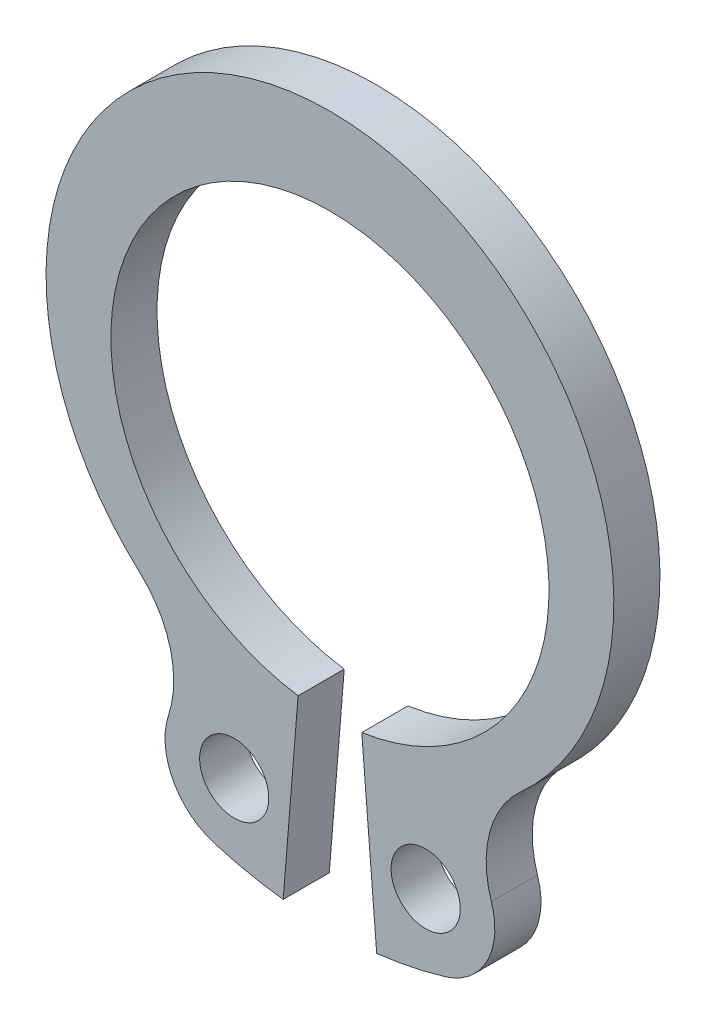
ISO-10303-21;
HEADER;
FILE_DESCRIPTION(('STEP AP214'),'2;1');
FILE_NAME('part.step','',(''),(''),'','','');
FILE_SCHEMA(('AUTOMOTIVE_DESIGN { 1 0 10303 214 1 1 1 1 }'));
ENDSEC;
DATA;
#1=APPLICATION_CONTEXT('core data for automotive mechanical design processes');
#2=APPLICATION_PROTOCOL_DEFINITION('international standard','automotive_design',2000,#1);
#3=PRODUCT_CONTEXT('',#1,'mechanical');
#4=PRODUCT('Part','Part','',(#3));
#5=PRODUCT_RELATED_PRODUCT_CATEGORY('part','',(#4));
#6=PRODUCT_DEFINITION_FORMATION('','',#4);
#7=PRODUCT_DEFINITION_CONTEXT('part definition',#1,'design');
#8=PRODUCT_DEFINITION('design','',#6,#7);
#9=PRODUCT_DEFINITION_SHAPE('','',#8);
#10=(LENGTH_UNIT() NAMED_UNIT(*) SI_UNIT(.MILLI.,.METRE.));
#11=(NAMED_UNIT(*) PLANE_ANGLE_UNIT() SI_UNIT($,.RADIAN.));
#12=(NAMED_UNIT(*) SI_UNIT($,.STERADIAN.) SOLID_ANGLE_UNIT());
#13=UNCERTAINTY_MEASURE_WITH_UNIT(LENGTH_MEASURE(1.E-05),#10,'distance_accuracy_value','');
#14=(GEOMETRIC_REPRESENTATION_CONTEXT(3) GLOBAL_UNCERTAINTY_ASSIGNED_CONTEXT((#13)) GLOBAL_UNIT_ASSIGNED_CONTEXT((#10,
#11,#12)) REPRESENTATION_CONTEXT('',''));
#15=CARTESIAN_POINT('',(0.,0.,0.));
#16=DIRECTION('',(0.,0.,1.));
#17=DIRECTION('',(1.,0.,0.));
#18=AXIS2_PLACEMENT_3D('',#15,#16,#17);
#19=CARTESIAN_POINT('',(0.,0.,0.800000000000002));
#20=DIRECTION('',(0.,0.,1.));
#21=DIRECTION('',(1.,0.,0.));
#22=AXIS2_PLACEMENT_3D('',#19,#20,#21);
#23=PLANE('',#22);
#24=CARTESIAN_POINT('',(-1.6610565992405,-5.55323839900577,0.800000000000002));
#25=DIRECTION('',(0.,0.,1.));
#26=DIRECTION('',(-1.,0.,0.));
#27=AXIS2_PLACEMENT_3D('',#24,#25,#26);
#28=CIRCLE('',#27,0.6);
#29=CARTESIAN_POINT('',(-2.2610565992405,-5.55323839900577,0.800000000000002));
#30=VERTEX_POINT('',#29);
#31=EDGE_CURVE('E120',#30,#30,#28,.T.);
#32=ORIENTED_EDGE('',*,*,#31,.F.);
#33=EDGE_LOOP('',(#32));
#34=FACE_BOUND('',#33,.T.);
#35=CARTESIAN_POINT('',(0.,0.,0.800000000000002));
#36=DIRECTION('',(0.,0.,-1.));
#37=DIRECTION('',(1.,0.,0.));
#38=AXIS2_PLACEMENT_3D('',#35,#36,#37);
#39=CIRCLE('',#38,3.8);
#40=CARTESIAN_POINT('',(-0.552363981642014,-3.75964014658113,0.800000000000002));
#41=VERTEX_POINT('',#40);
#42=CARTESIAN_POINT('',(0.552363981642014,-3.75964014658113,0.800000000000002));
#43=VERTEX_POINT('',#42);
#44=EDGE_CURVE('E142',#41,#43,#39,.T.);
#45=ORIENTED_EDGE('',*,*,#44,.T.);
#46=DIRECTION('',(0.0808768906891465,-0.996724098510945,0.));
#47=VECTOR('',#46,1.);
#48=CARTESIAN_POINT('',(0.552363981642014,-3.75964014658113,0.800000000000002));
#49=LINE('',#48,#47);
#50=CARTESIAN_POINT('',(0.811170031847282,-6.94915726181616,0.800000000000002));
#51=VERTEX_POINT('',#50);
#52=EDGE_CURVE('E115',#43,#51,#49,.T.);
#53=ORIENTED_EDGE('',*,*,#52,.T.);
#54=CARTESIAN_POINT('',(0.,0.,0.800000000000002));
#55=DIRECTION('',(0.,0.,1.));
#56=DIRECTION('',(1.,0.,0.));
#57=AXIS2_PLACEMENT_3D('',#54,#55,#56);
#58=CIRCLE('',#57,6.99634071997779);
#59=CARTESIAN_POINT('',(2.00494044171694,-6.70290961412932,0.800000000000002));
#60=VERTEX_POINT('',#59);
#61=EDGE_CURVE('E145',#51,#60,#58,.T.);
#62=ORIENTED_EDGE('',*,*,#61,.T.);
#63=CARTESIAN_POINT('',(1.6610565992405,-5.55323839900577,0.800000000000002));
#64=DIRECTION('',(0.,0.,1.));
#65=DIRECTION('',(1.,0.,0.));
#66=AXIS2_PLACEMENT_3D('',#63,#64,#65);
#67=CIRCLE('',#66,1.2);
#68=CARTESIAN_POINT('',(2.80066030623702,-5.17733496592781,0.800000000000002));
#69=VERTEX_POINT('',#68);
#70=EDGE_CURVE('E147',#60,#69,#67,.T.);
#71=ORIENTED_EDGE('',*,*,#70,.T.);
#72=CARTESIAN_POINT('',(4.51006586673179,-4.61347981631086,0.800000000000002));
#73=DIRECTION('',(0.,0.,-1.));
#74=DIRECTION('',(1.,0.,0.));
#75=AXIS2_PLACEMENT_3D('',#72,#73,#74);
#76=CIRCLE('',#75,1.8);
#77=CARTESIAN_POINT('',(3.30291069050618,-3.2782733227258,0.800000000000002));
#78=VERTEX_POINT('',#77);
#79=EDGE_CURVE('E149',#69,#78,#76,.T.);
#80=ORIENTED_EDGE('',*,*,#79,.T.);
#81=CARTESIAN_POINT('',(0.,0.375,0.800000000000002));
#82=DIRECTION('',(0.,0.,1.));
#83=DIRECTION('',(1.,0.,0.));
#84=AXIS2_PLACEMENT_3D('',#81,#82,#83);
#85=CIRCLE('',#84,4.925);
#86=CARTESIAN_POINT('',(-3.30291069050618,-3.2782733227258,0.800000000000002));
#87=VERTEX_POINT('',#86);
#88=EDGE_CURVE('E151',#78,#87,#85,.T.);
#89=ORIENTED_EDGE('',*,*,#88,.T.);
#90=CARTESIAN_POINT('',(-4.51006586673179,-4.61347981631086,0.800000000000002));
#91=DIRECTION('',(0.,0.,-1.));
#92=DIRECTION('',(-1.,0.,0.));
#93=AXIS2_PLACEMENT_3D('',#90,#91,#92);
#94=CIRCLE('',#93,1.8);
#95=CARTESIAN_POINT('',(-2.80066030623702,-5.17733496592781,0.800000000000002));
#96=VERTEX_POINT('',#95);
#97=EDGE_CURVE('E153',#87,#96,#94,.T.);
#98=ORIENTED_EDGE('',*,*,#97,.T.);
#99=CARTESIAN_POINT('',(-1.6610565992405,-5.55323839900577,0.800000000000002));
#100=DIRECTION('',(0.,0.,1.));
#101=DIRECTION('',(-1.,0.,0.));
#102=AXIS2_PLACEMENT_3D('',#99,#100,#101);
#103=CIRCLE('',#102,1.2);
#104=CARTESIAN_POINT('',(-2.00494044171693,-6.70290961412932,0.800000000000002));
#105=VERTEX_POINT('',#104);
#106=EDGE_CURVE('E155',#96,#105,#103,.T.);
#107=ORIENTED_EDGE('',*,*,#106,.T.);
#108=CARTESIAN_POINT('',(0.,0.,0.800000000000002));
#109=DIRECTION('',(0.,0.,1.));
#110=DIRECTION('',(-1.,0.,0.));
#111=AXIS2_PLACEMENT_3D('',#108,#109,#110);
#112=CIRCLE('',#111,6.99634071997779);
#113=CARTESIAN_POINT('',(-0.811170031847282,-6.94915726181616,0.800000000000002));
#114=VERTEX_POINT('',#113);
#115=EDGE_CURVE('E44',#105,#114,#112,.T.);
#116=ORIENTED_EDGE('',*,*,#115,.T.);
#117=DIRECTION('',(0.0808768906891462,0.996724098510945,0.));
#118=VECTOR('',#117,1.);
#119=CARTESIAN_POINT('',(-0.552363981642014,-3.75964014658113,0.800000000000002));
#120=LINE('',#119,#118);
#121=EDGE_CURVE('E39',#114,#41,#120,.T.);
#122=ORIENTED_EDGE('',*,*,#121,.T.);
#123=EDGE_LOOP('',(#45,#53,#62,#71,#80,#89,#98,#107,#116,#122));
#124=FACE_BOUND('',#123,.T.);
#125=CARTESIAN_POINT('',(1.6610565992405,-5.55323839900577,0.800000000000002));
#126=DIRECTION('',(0.,0.,1.));
#127=DIRECTION('',(1.,0.,0.));
#128=AXIS2_PLACEMENT_3D('',#125,#126,#127);
#129=CIRCLE('',#128,0.6);
#130=CARTESIAN_POINT('',(2.2610565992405,-5.55323839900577,0.800000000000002));
#131=VERTEX_POINT('',#130);
#132=EDGE_CURVE('E242',#131,#131,#129,.T.);
#133=ORIENTED_EDGE('',*,*,#132,.F.);
#134=EDGE_LOOP('',(#133));
#135=FACE_BOUND('',#134,.T.);
#136=ADVANCED_FACE('F24',(#34,#124,#135),#23,.T.);
#137=CARTESIAN_POINT('',(0.,0.,0.));
#138=DIRECTION('',(0.,0.,1.));
#139=DIRECTION('',(1.,0.,0.));
#140=AXIS2_PLACEMENT_3D('',#137,#138,#139);
#141=PLANE('',#140);
#142=CARTESIAN_POINT('',(-1.6610565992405,-5.55323839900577,0.));
#143=DIRECTION('',(0.,0.,1.));
#144=DIRECTION('',(-1.,0.,0.));
#145=AXIS2_PLACEMENT_3D('',#142,#143,#144);
#146=CIRCLE('',#145,0.6);
#147=CARTESIAN_POINT('',(-2.2610565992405,-5.55323839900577,0.));
#148=VERTEX_POINT('',#147);
#149=EDGE_CURVE('E123',#148,#148,#146,.T.);
#150=ORIENTED_EDGE('',*,*,#149,.T.);
#151=EDGE_LOOP('',(#150));
#152=FACE_BOUND('',#151,.T.);
#153=CARTESIAN_POINT('',(0.,0.,0.));
#154=DIRECTION('',(0.,0.,-1.));
#155=DIRECTION('',(1.,0.,0.));
#156=AXIS2_PLACEMENT_3D('',#153,#154,#155);
#157=CIRCLE('',#156,3.8);
#158=CARTESIAN_POINT('',(-0.552363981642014,-3.75964014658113,0.));
#159=VERTEX_POINT('',#158);
#160=CARTESIAN_POINT('',(0.552363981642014,-3.75964014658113,0.));
#161=VERTEX_POINT('',#160);
#162=EDGE_CURVE('E106',#159,#161,#157,.T.);
#163=ORIENTED_EDGE('',*,*,#162,.F.);
#164=DIRECTION('',(0.0808768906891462,0.996724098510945,0.));
#165=VECTOR('',#164,1.);
#166=CARTESIAN_POINT('',(-0.552363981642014,-3.75964014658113,0.));
#167=LINE('',#166,#165);
#168=CARTESIAN_POINT('',(-0.811170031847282,-6.94915726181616,0.));
#169=VERTEX_POINT('',#168);
#170=EDGE_CURVE('E140',#169,#159,#167,.T.);
#171=ORIENTED_EDGE('',*,*,#170,.F.);
#172=CARTESIAN_POINT('',(0.,0.,0.));
#173=DIRECTION('',(0.,0.,1.));
#174=DIRECTION('',(-1.,0.,0.));
#175=AXIS2_PLACEMENT_3D('',#172,#173,#174);
#176=CIRCLE('',#175,6.99634071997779);
#177=CARTESIAN_POINT('',(-2.00494044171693,-6.70290961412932,0.));
#178=VERTEX_POINT('',#177);
#179=EDGE_CURVE('E138',#178,#169,#176,.T.);
#180=ORIENTED_EDGE('',*,*,#179,.F.);
#181=CARTESIAN_POINT('',(-1.6610565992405,-5.55323839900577,0.));
#182=DIRECTION('',(0.,0.,1.));
#183=DIRECTION('',(-1.,0.,0.));
#184=AXIS2_PLACEMENT_3D('',#181,#182,#183);
#185=CIRCLE('',#184,1.2);
#186=CARTESIAN_POINT('',(-2.80066030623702,-5.17733496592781,0.));
#187=VERTEX_POINT('',#186);
#188=EDGE_CURVE('E136',#187,#178,#185,.T.);
#189=ORIENTED_EDGE('',*,*,#188,.F.);
#190=CARTESIAN_POINT('',(-4.51006586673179,-4.61347981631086,0.));
#191=DIRECTION('',(0.,0.,-1.));
#192=DIRECTION('',(-1.,0.,0.));
#193=AXIS2_PLACEMENT_3D('',#190,#191,#192);
#194=CIRCLE('',#193,1.8);
#195=CARTESIAN_POINT('',(-3.30291069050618,-3.2782733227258,0.));
#196=VERTEX_POINT('',#195);
#197=EDGE_CURVE('E134',#196,#187,#194,.T.);
#198=ORIENTED_EDGE('',*,*,#197,.F.);
#199=CARTESIAN_POINT('',(0.,0.375,0.));
#200=DIRECTION('',(0.,0.,1.));
#201=DIRECTION('',(1.,0.,0.));
#202=AXIS2_PLACEMENT_3D('',#199,#200,#201);
#203=CIRCLE('',#202,4.925);
#204=CARTESIAN_POINT('',(3.30291069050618,-3.2782733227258,0.));
#205=VERTEX_POINT('',#204);
#206=EDGE_CURVE('E132',#205,#196,#203,.T.);
#207=ORIENTED_EDGE('',*,*,#206,.F.);
#208=CARTESIAN_POINT('',(4.51006586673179,-4.61347981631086,0.));
#209=DIRECTION('',(0.,0.,-1.));
#210=DIRECTION('',(1.,0.,0.));
#211=AXIS2_PLACEMENT_3D('',#208,#209,#210);
#212=CIRCLE('',#211,1.8);
#213=CARTESIAN_POINT('',(2.80066030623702,-5.17733496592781,0.));
#214=VERTEX_POINT('',#213);
#215=EDGE_CURVE('E130',#214,#205,#212,.T.);
#216=ORIENTED_EDGE('',*,*,#215,.F.);
#217=CARTESIAN_POINT('',(1.6610565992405,-5.55323839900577,0.));
#218=DIRECTION('',(0.,0.,1.));
#219=DIRECTION('',(1.,0.,0.));
#220=AXIS2_PLACEMENT_3D('',#217,#218,#219);
#221=CIRCLE('',#220,1.2);
#222=CARTESIAN_POINT('',(2.00494044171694,-6.70290961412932,0.));
#223=VERTEX_POINT('',#222);
#224=EDGE_CURVE('E128',#223,#214,#221,.T.);
#225=ORIENTED_EDGE('',*,*,#224,.F.);
#226=CARTESIAN_POINT('',(0.,0.,0.));
#227=DIRECTION('',(0.,0.,1.));
#228=DIRECTION('',(1.,0.,0.));
#229=AXIS2_PLACEMENT_3D('',#226,#227,#228);
#230=CIRCLE('',#229,6.99634071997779);
#231=CARTESIAN_POINT('',(0.811170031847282,-6.94915726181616,0.));
#232=VERTEX_POINT('',#231);
#233=EDGE_CURVE('E108',#232,#223,#230,.T.);
#234=ORIENTED_EDGE('',*,*,#233,.F.);
#235=DIRECTION('',(0.0808768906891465,-0.996724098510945,0.));
#236=VECTOR('',#235,1.);
#237=CARTESIAN_POINT('',(0.552363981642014,-3.75964014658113,0.));
#238=LINE('',#237,#236);
#239=EDGE_CURVE('E101',#161,#232,#238,.T.);
#240=ORIENTED_EDGE('',*,*,#239,.F.);
#241=EDGE_LOOP('',(#163,#171,#180,#189,#198,#207,#216,#225,#234,#240));
#242=FACE_BOUND('',#241,.T.);
#243=CARTESIAN_POINT('',(1.6610565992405,-5.55323839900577,0.));
#244=DIRECTION('',(0.,0.,1.));
#245=DIRECTION('',(1.,0.,0.));
#246=AXIS2_PLACEMENT_3D('',#243,#244,#245);
#247=CIRCLE('',#246,0.6);
#248=CARTESIAN_POINT('',(2.2610565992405,-5.55323839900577,0.));
#249=VERTEX_POINT('',#248);
#250=EDGE_CURVE('E245',#249,#249,#247,.T.);
#251=ORIENTED_EDGE('',*,*,#250,.T.);
#252=EDGE_LOOP('',(#251));
#253=FACE_BOUND('',#252,.T.);
#254=ADVANCED_FACE('F102',(#152,#242,#253),#141,.F.);
#255=CARTESIAN_POINT('',(0.,0.,0.800000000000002));
#256=DIRECTION('',(0.,0.,-1.));
#257=DIRECTION('',(-1.,0.,0.));
#258=AXIS2_PLACEMENT_3D('',#255,#256,#257);
#259=CYLINDRICAL_SURFACE('',#258,3.8);
#260=ORIENTED_EDGE('',*,*,#162,.T.);
#261=DIRECTION('',(0.,0.,-1.));
#262=VECTOR('',#261,1.);
#263=CARTESIAN_POINT('',(0.552363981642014,-3.75964014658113,0.800000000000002));
#264=LINE('',#263,#262);
#265=EDGE_CURVE('E11',#43,#161,#264,.T.);
#266=ORIENTED_EDGE('',*,*,#265,.F.);
#267=ORIENTED_EDGE('',*,*,#44,.F.);
#268=DIRECTION('',(0.,0.,-1.));
#269=VECTOR('',#268,1.);
#270=CARTESIAN_POINT('',(-0.552363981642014,-3.75964014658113,0.800000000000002));
#271=LINE('',#270,#269);
#272=EDGE_CURVE('E119',#41,#159,#271,.T.);
#273=ORIENTED_EDGE('',*,*,#272,.T.);
#274=EDGE_LOOP('',(#260,#266,#267,#273));
#275=FACE_BOUND('',#274,.T.);
#276=ADVANCED_FACE('F26',(#275),#259,.F.);
#277=CARTESIAN_POINT('',(0.552363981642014,-3.75964014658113,0.800000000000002));
#278=DIRECTION('',(0.996724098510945,0.0808768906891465,0.));
#279=DIRECTION('',(-0.0808768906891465,0.996724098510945,0.));
#280=AXIS2_PLACEMENT_3D('',#277,#278,#279);
#281=PLANE('',#280);
#282=ORIENTED_EDGE('',*,*,#239,.T.);
#283=DIRECTION('',(0.,0.,-1.));
#284=VECTOR('',#283,1.);
#285=CARTESIAN_POINT('',(0.811170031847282,-6.94915726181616,0.800000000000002));
#286=LINE('',#285,#284);
#287=EDGE_CURVE('E32',#51,#232,#286,.T.);
#288=ORIENTED_EDGE('',*,*,#287,.F.);
#289=ORIENTED_EDGE('',*,*,#52,.F.);
#290=ORIENTED_EDGE('',*,*,#265,.T.);
#291=EDGE_LOOP('',(#282,#288,#289,#290));
#292=FACE_BOUND('',#291,.T.);
#293=ADVANCED_FACE('F114',(#292),#281,.F.);
#294=CARTESIAN_POINT('',(0.,0.,0.800000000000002));
#295=DIRECTION('',(0.,0.,-1.));
#296=DIRECTION('',(-1.,0.,0.));
#297=AXIS2_PLACEMENT_3D('',#294,#295,#296);
#298=CYLINDRICAL_SURFACE('',#297,6.99634071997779);
#299=ORIENTED_EDGE('',*,*,#233,.T.);
#300=DIRECTION('',(0.,0.,-1.));
#301=VECTOR('',#300,1.);
#302=CARTESIAN_POINT('',(2.00494044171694,-6.70290961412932,0.800000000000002));
#303=LINE('',#302,#301);
#304=EDGE_CURVE('E178',#60,#223,#303,.T.);
#305=ORIENTED_EDGE('',*,*,#304,.F.);
#306=ORIENTED_EDGE('',*,*,#61,.F.);
#307=ORIENTED_EDGE('',*,*,#287,.T.);
#308=EDGE_LOOP('',(#299,#305,#306,#307));
#309=FACE_BOUND('',#308,.T.);
#310=ADVANCED_FACE('F182',(#309),#298,.T.);
#311=CARTESIAN_POINT('',(1.6610565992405,-5.55323839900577,0.800000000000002));
#312=DIRECTION('',(0.,0.,-1.));
#313=DIRECTION('',(-1.,0.,0.));
#314=AXIS2_PLACEMENT_3D('',#311,#312,#313);
#315=CYLINDRICAL_SURFACE('',#314,1.2);
#316=ORIENTED_EDGE('',*,*,#224,.T.);
#317=DIRECTION('',(0.,0.,-1.));
#318=VECTOR('',#317,1.);
#319=CARTESIAN_POINT('',(2.80066030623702,-5.17733496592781,0.800000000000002));
#320=LINE('',#319,#318);
#321=EDGE_CURVE('E175',#69,#214,#320,.T.);
#322=ORIENTED_EDGE('',*,*,#321,.F.);
#323=ORIENTED_EDGE('',*,*,#70,.F.);
#324=ORIENTED_EDGE('',*,*,#304,.T.);
#325=EDGE_LOOP('',(#316,#322,#323,#324));
#326=FACE_BOUND('',#325,.T.);
#327=ADVANCED_FACE('F190',(#326),#315,.T.);
#328=CARTESIAN_POINT('',(4.51006586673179,-4.61347981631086,0.800000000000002));
#329=DIRECTION('',(0.,0.,-1.));
#330=DIRECTION('',(-1.,0.,0.));
#331=AXIS2_PLACEMENT_3D('',#328,#329,#330);
#332=CYLINDRICAL_SURFACE('',#331,1.8);
#333=ORIENTED_EDGE('',*,*,#215,.T.);
#334=DIRECTION('',(0.,0.,-1.));
#335=VECTOR('',#334,1.);
#336=CARTESIAN_POINT('',(3.30291069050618,-3.2782733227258,0.800000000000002));
#337=LINE('',#336,#335);
#338=EDGE_CURVE('E172',#78,#205,#337,.T.);
#339=ORIENTED_EDGE('',*,*,#338,.F.);
#340=ORIENTED_EDGE('',*,*,#79,.F.);
#341=ORIENTED_EDGE('',*,*,#321,.T.);
#342=EDGE_LOOP('',(#333,#339,#340,#341));
#343=FACE_BOUND('',#342,.T.);
#344=ADVANCED_FACE('F193',(#343),#332,.F.);
#345=CARTESIAN_POINT('',(0.,0.375,0.800000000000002));
#346=DIRECTION('',(0.,0.,-1.));
#347=DIRECTION('',(-1.,0.,0.));
#348=AXIS2_PLACEMENT_3D('',#345,#346,#347);
#349=CYLINDRICAL_SURFACE('',#348,4.925);
#350=ORIENTED_EDGE('',*,*,#206,.T.);
#351=DIRECTION('',(0.,0.,-1.));
#352=VECTOR('',#351,1.);
#353=CARTESIAN_POINT('',(-3.30291069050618,-3.2782733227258,0.800000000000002));
#354=LINE('',#353,#352);
#355=EDGE_CURVE('E169',#87,#196,#354,.T.);
#356=ORIENTED_EDGE('',*,*,#355,.F.);
#357=ORIENTED_EDGE('',*,*,#88,.F.);
#358=ORIENTED_EDGE('',*,*,#338,.T.);
#359=EDGE_LOOP('',(#350,#356,#357,#358));
#360=FACE_BOUND('',#359,.T.);
#361=ADVANCED_FACE('F198',(#360),#349,.T.);
#362=CARTESIAN_POINT('',(-4.51006586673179,-4.61347981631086,0.800000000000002));
#363=DIRECTION('',(0.,0.,-1.));
#364=DIRECTION('',(-1.,0.,0.));
#365=AXIS2_PLACEMENT_3D('',#362,#363,#364);
#366=CYLINDRICAL_SURFACE('',#365,1.8);
#367=ORIENTED_EDGE('',*,*,#197,.T.);
#368=DIRECTION('',(0.,0.,-1.));
#369=VECTOR('',#368,1.);
#370=CARTESIAN_POINT('',(-2.80066030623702,-5.17733496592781,0.800000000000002));
#371=LINE('',#370,#369);
#372=EDGE_CURVE('E166',#96,#187,#371,.T.);
#373=ORIENTED_EDGE('',*,*,#372,.F.);
#374=ORIENTED_EDGE('',*,*,#97,.F.);
#375=ORIENTED_EDGE('',*,*,#355,.T.);
#376=EDGE_LOOP('',(#367,#373,#374,#375));
#377=FACE_BOUND('',#376,.T.);
#378=ADVANCED_FACE('F204',(#377),#366,.F.);
#379=CARTESIAN_POINT('',(-1.6610565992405,-5.55323839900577,0.800000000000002));
#380=DIRECTION('',(0.,0.,-1.));
#381=DIRECTION('',(-1.,0.,0.));
#382=AXIS2_PLACEMENT_3D('',#379,#380,#381);
#383=CYLINDRICAL_SURFACE('',#382,1.2);
#384=ORIENTED_EDGE('',*,*,#188,.T.);
#385=DIRECTION('',(0.,0.,-1.));
#386=VECTOR('',#385,1.);
#387=CARTESIAN_POINT('',(-2.00494044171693,-6.70290961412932,0.800000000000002));
#388=LINE('',#387,#386);
#389=EDGE_CURVE('E163',#105,#178,#388,.T.);
#390=ORIENTED_EDGE('',*,*,#389,.F.);
#391=ORIENTED_EDGE('',*,*,#106,.F.);
#392=ORIENTED_EDGE('',*,*,#372,.T.);
#393=EDGE_LOOP('',(#384,#390,#391,#392));
#394=FACE_BOUND('',#393,.T.);
#395=ADVANCED_FACE('F208',(#394),#383,.T.);
#396=CARTESIAN_POINT('',(0.,0.,0.800000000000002));
#397=DIRECTION('',(0.,0.,-1.));
#398=DIRECTION('',(-1.,0.,0.));
#399=AXIS2_PLACEMENT_3D('',#396,#397,#398);
#400=CYLINDRICAL_SURFACE('',#399,6.99634071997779);
#401=ORIENTED_EDGE('',*,*,#179,.T.);
#402=DIRECTION('',(0.,0.,-1.));
#403=VECTOR('',#402,1.);
#404=CARTESIAN_POINT('',(-0.811170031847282,-6.94915726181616,0.800000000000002));
#405=LINE('',#404,#403);
#406=EDGE_CURVE('E160',#114,#169,#405,.T.);
#407=ORIENTED_EDGE('',*,*,#406,.F.);
#408=ORIENTED_EDGE('',*,*,#115,.F.);
#409=ORIENTED_EDGE('',*,*,#389,.T.);
#410=EDGE_LOOP('',(#401,#407,#408,#409));
#411=FACE_BOUND('',#410,.T.);
#412=ADVANCED_FACE('F211',(#411),#400,.T.);
#413=CARTESIAN_POINT('',(-0.552363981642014,-3.75964014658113,0.800000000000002));
#414=DIRECTION('',(-0.996724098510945,0.0808768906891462,0.));
#415=DIRECTION('',(-0.0808768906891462,-0.996724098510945,0.));
#416=AXIS2_PLACEMENT_3D('',#413,#414,#415);
#417=PLANE('',#416);
#418=ORIENTED_EDGE('',*,*,#170,.T.);
#419=ORIENTED_EDGE('',*,*,#272,.F.);
#420=ORIENTED_EDGE('',*,*,#121,.F.);
#421=ORIENTED_EDGE('',*,*,#406,.T.);
#422=EDGE_LOOP('',(#418,#419,#420,#421));
#423=FACE_BOUND('',#422,.T.);
#424=ADVANCED_FACE('F213',(#423),#417,.F.);
#425=CARTESIAN_POINT('',(-1.6610565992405,-5.55323839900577,0.800000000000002));
#426=DIRECTION('',(0.,0.,-1.));
#427=DIRECTION('',(-1.,0.,0.));
#428=AXIS2_PLACEMENT_3D('',#425,#426,#427);
#429=CYLINDRICAL_SURFACE('',#428,0.6);
#430=ORIENTED_EDGE('',*,*,#31,.T.);
#431=EDGE_LOOP('',(#430));
#432=FACE_BOUND('',#431,.T.);
#433=ORIENTED_EDGE('',*,*,#149,.F.);
#434=EDGE_LOOP('',(#433));
#435=FACE_BOUND('',#434,.T.);
#436=ADVANCED_FACE('F215',(#432,#435),#429,.F.);
#437=CARTESIAN_POINT('',(1.6610565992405,-5.55323839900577,0.800000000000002));
#438=DIRECTION('',(0.,0.,-1.));
#439=DIRECTION('',(-1.,0.,0.));
#440=AXIS2_PLACEMENT_3D('',#437,#438,#439);
#441=CYLINDRICAL_SURFACE('',#440,0.6);
#442=ORIENTED_EDGE('',*,*,#132,.T.);
#443=EDGE_LOOP('',(#442));
#444=FACE_BOUND('',#443,.T.);
#445=ORIENTED_EDGE('',*,*,#250,.F.);
#446=EDGE_LOOP('',(#445));
#447=FACE_BOUND('',#446,.T.);
#448=ADVANCED_FACE('F221',(#444,#447),#441,.F.);
#449=CLOSED_SHELL('',(#136,#254,#276,#293,#310,#327,#344,#361,#378,#395,#412,#424,#436,#448));
#450=MANIFOLD_SOLID_BREP('B2',#449);
#451=ADVANCED_BREP_SHAPE_REPRESENTATION('',(#18,#450),#14);
#452=SHAPE_DEFINITION_REPRESENTATION(#9,#451);
ENDSEC;
END-ISO-10303-21;
